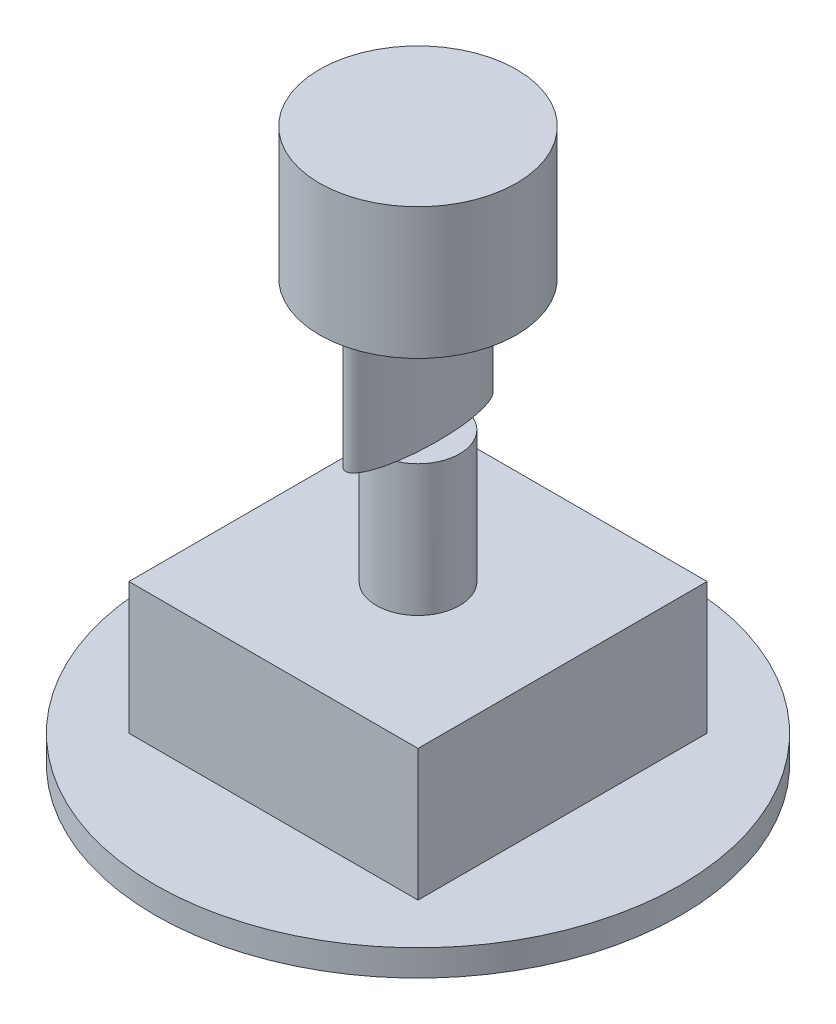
ISO-10303-21;
HEADER;
FILE_DESCRIPTION(('STEP AP214'),'2;1');
FILE_NAME('part.step','',(''),(''),'','','');
FILE_SCHEMA(('AUTOMOTIVE_DESIGN { 1 0 10303 214 1 1 1 1 }'));
ENDSEC;
DATA;
#1=APPLICATION_CONTEXT('core data for automotive mechanical design processes');
#2=APPLICATION_PROTOCOL_DEFINITION('international standard','automotive_design',2000,#1);
#3=PRODUCT_CONTEXT('',#1,'mechanical');
#4=PRODUCT('Part','Part','',(#3));
#5=PRODUCT_RELATED_PRODUCT_CATEGORY('part','',(#4));
#6=PRODUCT_DEFINITION_FORMATION('','',#4);
#7=PRODUCT_DEFINITION_CONTEXT('part definition',#1,'design');
#8=PRODUCT_DEFINITION('design','',#6,#7);
#9=PRODUCT_DEFINITION_SHAPE('','',#8);
#10=(LENGTH_UNIT() NAMED_UNIT(*) SI_UNIT(.MILLI.,.METRE.));
#11=(NAMED_UNIT(*) PLANE_ANGLE_UNIT() SI_UNIT($,.RADIAN.));
#12=(NAMED_UNIT(*) SI_UNIT($,.STERADIAN.) SOLID_ANGLE_UNIT());
#13=UNCERTAINTY_MEASURE_WITH_UNIT(LENGTH_MEASURE(1.E-05),#10,'distance_accuracy_value','');
#14=(GEOMETRIC_REPRESENTATION_CONTEXT(3) GLOBAL_UNCERTAINTY_ASSIGNED_CONTEXT((#13)) GLOBAL_UNIT_ASSIGNED_CONTEXT((#10,
#11,#12)) REPRESENTATION_CONTEXT('',''));
#15=CARTESIAN_POINT('',(0.,0.,0.));
#16=DIRECTION('',(0.,0.,1.));
#17=DIRECTION('',(1.,0.,0.));
#18=AXIS2_PLACEMENT_3D('',#15,#16,#17);
#19=CARTESIAN_POINT('',(0.,21.,0.));
#20=DIRECTION('',(0.,1.,0.));
#21=DIRECTION('',(0.,0.,1.));
#22=AXIS2_PLACEMENT_3D('',#19,#20,#21);
#23=PLANE('',#22);
#24=CARTESIAN_POINT('',(0.,21.,0.));
#25=DIRECTION('',(0.,1.,0.));
#26=DIRECTION('',(0.,0.,1.));
#27=AXIS2_PLACEMENT_3D('',#24,#25,#26);
#28=ELLIPSE('',#27,5.5,1.5);
#29=CARTESIAN_POINT('',(1.27408896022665,21.,2.90268794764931));
#30=VERTEX_POINT('',#29);
#31=CARTESIAN_POINT('',(1.27408896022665,21.,-2.90268794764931));
#32=VERTEX_POINT('',#31);
#33=EDGE_CURVE('E41',#30,#32,#28,.T.);
#34=ORIENTED_EDGE('',*,*,#33,.F.);
#35=CARTESIAN_POINT('',(0.,21.,0.));
#36=DIRECTION('',(0.,1.,0.));
#37=DIRECTION('',(0.,0.,1.));
#38=AXIS2_PLACEMENT_3D('',#35,#36,#37);
#39=CIRCLE('',#38,3.17);
#40=EDGE_CURVE('E92',#30,#32,#39,.T.);
#41=ORIENTED_EDGE('',*,*,#40,.T.);
#42=EDGE_LOOP('',(#34,#41));
#43=FACE_BOUND('',#42,.T.);
#44=ADVANCED_FACE('F31',(#43),#23,.T.);
#45=CARTESIAN_POINT('',(-11.,11.,11.));
#46=DIRECTION('',(0.,-1.,0.));
#47=DIRECTION('',(0.,0.,-1.));
#48=AXIS2_PLACEMENT_3D('',#45,#46,#47);
#49=PLANE('',#48);
#50=DIRECTION('',(0.,0.,1.));
#51=VECTOR('',#50,1.);
#52=CARTESIAN_POINT('',(-11.,11.,-11.));
#53=LINE('',#52,#51);
#54=CARTESIAN_POINT('',(-11.,11.,-11.));
#55=VERTEX_POINT('',#54);
#56=CARTESIAN_POINT('',(-11.,11.,11.));
#57=VERTEX_POINT('',#56);
#58=EDGE_CURVE('E110',#55,#57,#53,.T.);
#59=ORIENTED_EDGE('',*,*,#58,.T.);
#60=DIRECTION('',(1.,0.,0.));
#61=VECTOR('',#60,1.);
#62=CARTESIAN_POINT('',(11.,11.,11.));
#63=LINE('',#62,#61);
#64=CARTESIAN_POINT('',(11.,11.,11.));
#65=VERTEX_POINT('',#64);
#66=EDGE_CURVE('E113',#57,#65,#63,.T.);
#67=ORIENTED_EDGE('',*,*,#66,.T.);
#68=DIRECTION('',(0.,0.,-1.));
#69=VECTOR('',#68,1.);
#70=CARTESIAN_POINT('',(11.,11.,-11.));
#71=LINE('',#70,#69);
#72=CARTESIAN_POINT('',(11.,11.,-11.));
#73=VERTEX_POINT('',#72);
#74=EDGE_CURVE('E116',#65,#73,#71,.T.);
#75=ORIENTED_EDGE('',*,*,#74,.T.);
#76=DIRECTION('',(-1.,0.,0.));
#77=VECTOR('',#76,1.);
#78=CARTESIAN_POINT('',(11.,11.,-11.));
#79=LINE('',#78,#77);
#80=EDGE_CURVE('E118',#73,#55,#79,.T.);
#81=ORIENTED_EDGE('',*,*,#80,.T.);
#82=EDGE_LOOP('',(#59,#67,#75,#81));
#83=FACE_BOUND('',#82,.T.);
#84=CARTESIAN_POINT('',(0.,11.,0.));
#85=DIRECTION('',(0.,-1.,0.));
#86=DIRECTION('',(0.,0.,-1.));
#87=AXIS2_PLACEMENT_3D('',#84,#85,#86);
#88=CIRCLE('',#87,3.17);
#89=CARTESIAN_POINT('',(0.,11.,-3.17));
#90=VERTEX_POINT('',#89);
#91=EDGE_CURVE('E35',#90,#90,#88,.F.);
#92=ORIENTED_EDGE('',*,*,#91,.F.);
#93=EDGE_LOOP('',(#92));
#94=FACE_BOUND('',#93,.T.);
#95=ADVANCED_FACE('F159',(#83,#94),#49,.F.);
#96=CARTESIAN_POINT('',(0.,1.,0.));
#97=DIRECTION('',(0.,1.,0.));
#98=DIRECTION('',(0.,0.,1.));
#99=AXIS2_PLACEMENT_3D('',#96,#97,#98);
#100=PLANE('',#99);
#101=CARTESIAN_POINT('',(0.,1.,0.));
#102=DIRECTION('',(0.,1.,0.));
#103=DIRECTION('',(0.,0.,1.));
#104=AXIS2_PLACEMENT_3D('',#101,#102,#103);
#105=CIRCLE('',#104,20.);
#106=CARTESIAN_POINT('',(0.,1.,20.));
#107=VERTEX_POINT('',#106);
#108=EDGE_CURVE('E139',#107,#107,#105,.T.);
#109=ORIENTED_EDGE('',*,*,#108,.T.);
#110=EDGE_LOOP('',(#109));
#111=FACE_BOUND('',#110,.T.);
#112=DIRECTION('',(1.,0.,0.));
#113=VECTOR('',#112,1.);
#114=CARTESIAN_POINT('',(11.,1.,11.));
#115=LINE('',#114,#113);
#116=CARTESIAN_POINT('',(-11.,1.,11.));
#117=VERTEX_POINT('',#116);
#118=CARTESIAN_POINT('',(11.,1.,11.));
#119=VERTEX_POINT('',#118);
#120=EDGE_CURVE('E123',#117,#119,#115,.T.);
#121=ORIENTED_EDGE('',*,*,#120,.F.);
#122=DIRECTION('',(0.,0.,1.));
#123=VECTOR('',#122,1.);
#124=CARTESIAN_POINT('',(-11.,1.,-11.));
#125=LINE('',#124,#123);
#126=CARTESIAN_POINT('',(-11.,1.,-11.));
#127=VERTEX_POINT('',#126);
#128=EDGE_CURVE('E109',#127,#117,#125,.T.);
#129=ORIENTED_EDGE('',*,*,#128,.F.);
#130=DIRECTION('',(-1.,0.,0.));
#131=VECTOR('',#130,1.);
#132=CARTESIAN_POINT('',(11.,1.,-11.));
#133=LINE('',#132,#131);
#134=CARTESIAN_POINT('',(11.,1.,-11.));
#135=VERTEX_POINT('',#134);
#136=EDGE_CURVE('E114',#135,#127,#133,.T.);
#137=ORIENTED_EDGE('',*,*,#136,.F.);
#138=DIRECTION('',(0.,0.,-1.));
#139=VECTOR('',#138,1.);
#140=CARTESIAN_POINT('',(11.,1.,-11.));
#141=LINE('',#140,#139);
#142=EDGE_CURVE('E125',#119,#135,#141,.T.);
#143=ORIENTED_EDGE('',*,*,#142,.F.);
#144=EDGE_LOOP('',(#121,#129,#137,#143));
#145=FACE_BOUND('',#144,.T.);
#146=ADVANCED_FACE('F155',(#111,#145),#100,.T.);
#147=CARTESIAN_POINT('',(0.,1.,0.));
#148=DIRECTION('',(0.,-1.,0.));
#149=DIRECTION('',(0.,0.,-1.));
#150=AXIS2_PLACEMENT_3D('',#147,#148,#149);
#151=CYLINDRICAL_SURFACE('',#150,20.);
#152=ORIENTED_EDGE('',*,*,#108,.F.);
#153=EDGE_LOOP('',(#152));
#154=FACE_BOUND('',#153,.T.);
#155=CARTESIAN_POINT('',(0.,-1.,0.));
#156=DIRECTION('',(0.,1.,0.));
#157=DIRECTION('',(0.,0.,1.));
#158=AXIS2_PLACEMENT_3D('',#155,#156,#157);
#159=CIRCLE('',#158,20.);
#160=CARTESIAN_POINT('',(0.,-1.,20.));
#161=VERTEX_POINT('',#160);
#162=EDGE_CURVE('E138',#161,#161,#159,.T.);
#163=ORIENTED_EDGE('',*,*,#162,.T.);
#164=EDGE_LOOP('',(#163));
#165=FACE_BOUND('',#164,.T.);
#166=ADVANCED_FACE('F33',(#154,#165),#151,.T.);
#167=CARTESIAN_POINT('',(0.,-1.,0.));
#168=DIRECTION('',(0.,1.,0.));
#169=DIRECTION('',(0.,0.,1.));
#170=AXIS2_PLACEMENT_3D('',#167,#168,#169);
#171=PLANE('',#170);
#172=ORIENTED_EDGE('',*,*,#162,.F.);
#173=EDGE_LOOP('',(#172));
#174=FACE_BOUND('',#173,.T.);
#175=ADVANCED_FACE('F145',(#174),#171,.F.);
#176=CARTESIAN_POINT('',(-11.,11.,-11.));
#177=DIRECTION('',(1.,0.,0.));
#178=DIRECTION('',(0.,0.,-1.));
#179=AXIS2_PLACEMENT_3D('',#176,#177,#178);
#180=PLANE('',#179);
#181=ORIENTED_EDGE('',*,*,#128,.T.);
#182=DIRECTION('',(0.,-1.,0.));
#183=VECTOR('',#182,1.);
#184=CARTESIAN_POINT('',(-11.,11.,11.));
#185=LINE('',#184,#183);
#186=EDGE_CURVE('E136',#57,#117,#185,.T.);
#187=ORIENTED_EDGE('',*,*,#186,.F.);
#188=ORIENTED_EDGE('',*,*,#58,.F.);
#189=DIRECTION('',(0.,-1.,0.));
#190=VECTOR('',#189,1.);
#191=CARTESIAN_POINT('',(-11.,11.,-11.));
#192=LINE('',#191,#190);
#193=EDGE_CURVE('E120',#55,#127,#192,.T.);
#194=ORIENTED_EDGE('',*,*,#193,.T.);
#195=EDGE_LOOP('',(#181,#187,#188,#194));
#196=FACE_BOUND('',#195,.T.);
#197=ADVANCED_FACE('F147',(#196),#180,.F.);
#198=CARTESIAN_POINT('',(11.,11.,11.));
#199=DIRECTION('',(0.,0.,-1.));
#200=DIRECTION('',(-1.,0.,0.));
#201=AXIS2_PLACEMENT_3D('',#198,#199,#200);
#202=PLANE('',#201);
#203=ORIENTED_EDGE('',*,*,#120,.T.);
#204=DIRECTION('',(0.,-1.,0.));
#205=VECTOR('',#204,1.);
#206=CARTESIAN_POINT('',(11.,11.,11.));
#207=LINE('',#206,#205);
#208=EDGE_CURVE('E133',#65,#119,#207,.T.);
#209=ORIENTED_EDGE('',*,*,#208,.F.);
#210=ORIENTED_EDGE('',*,*,#66,.F.);
#211=ORIENTED_EDGE('',*,*,#186,.T.);
#212=EDGE_LOOP('',(#203,#209,#210,#211));
#213=FACE_BOUND('',#212,.T.);
#214=ADVANCED_FACE('F152',(#213),#202,.F.);
#215=CARTESIAN_POINT('',(11.,11.,-11.));
#216=DIRECTION('',(-1.,0.,0.));
#217=DIRECTION('',(0.,0.,1.));
#218=AXIS2_PLACEMENT_3D('',#215,#216,#217);
#219=PLANE('',#218);
#220=ORIENTED_EDGE('',*,*,#142,.T.);
#221=DIRECTION('',(0.,-1.,0.));
#222=VECTOR('',#221,1.);
#223=CARTESIAN_POINT('',(11.,11.,-11.));
#224=LINE('',#223,#222);
#225=EDGE_CURVE('E131',#73,#135,#224,.T.);
#226=ORIENTED_EDGE('',*,*,#225,.F.);
#227=ORIENTED_EDGE('',*,*,#74,.F.);
#228=ORIENTED_EDGE('',*,*,#208,.T.);
#229=EDGE_LOOP('',(#220,#226,#227,#228));
#230=FACE_BOUND('',#229,.T.);
#231=ADVANCED_FACE('F180',(#230),#219,.F.);
#232=CARTESIAN_POINT('',(11.,11.,-11.));
#233=DIRECTION('',(0.,0.,1.));
#234=DIRECTION('',(1.,0.,0.));
#235=AXIS2_PLACEMENT_3D('',#232,#233,#234);
#236=PLANE('',#235);
#237=ORIENTED_EDGE('',*,*,#136,.T.);
#238=ORIENTED_EDGE('',*,*,#193,.F.);
#239=ORIENTED_EDGE('',*,*,#80,.F.);
#240=ORIENTED_EDGE('',*,*,#225,.T.);
#241=EDGE_LOOP('',(#237,#238,#239,#240));
#242=FACE_BOUND('',#241,.T.);
#243=ADVANCED_FACE('F176',(#242),#236,.F.);
#244=CARTESIAN_POINT('',(0.,21.,0.));
#245=DIRECTION('',(0.,-1.,0.));
#246=DIRECTION('',(0.,0.,-1.));
#247=AXIS2_PLACEMENT_3D('',#244,#245,#246);
#248=CYLINDRICAL_SURFACE('',#247,3.17);
#249=ORIENTED_EDGE('',*,*,#40,.F.);
#250=CARTESIAN_POINT('',(-1.27408896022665,21.,2.90268794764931));
#251=VERTEX_POINT('',#250);
#252=EDGE_CURVE('E86',#251,#30,#39,.T.);
#253=ORIENTED_EDGE('',*,*,#252,.F.);
#254=CARTESIAN_POINT('',(-1.27408896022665,21.,-2.90268794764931));
#255=VERTEX_POINT('',#254);
#256=EDGE_CURVE('E83',#255,#251,#39,.T.);
#257=ORIENTED_EDGE('',*,*,#256,.F.);
#258=EDGE_CURVE('E53',#32,#255,#39,.T.);
#259=ORIENTED_EDGE('',*,*,#258,.F.);
#260=EDGE_LOOP('',(#249,#253,#257,#259));
#261=FACE_BOUND('',#260,.T.);
#262=ORIENTED_EDGE('',*,*,#91,.T.);
#263=EDGE_LOOP('',(#262));
#264=FACE_BOUND('',#263,.T.);
#265=ADVANCED_FACE('F90',(#261,#264),#248,.T.);
#266=EDGE_CURVE('E11',#255,#251,#28,.T.);
#267=ORIENTED_EDGE('',*,*,#266,.F.);
#268=ORIENTED_EDGE('',*,*,#256,.T.);
#269=EDGE_LOOP('',(#267,#268));
#270=FACE_BOUND('',#269,.T.);
#271=ADVANCED_FACE('F85',(#270),#23,.T.);
#272=CARTESIAN_POINT('',(0.,21.,0.));
#273=DIRECTION('',(0.,1.,0.));
#274=DIRECTION('',(0.,0.,1.));
#275=AXIS2_PLACEMENT_3D('',#272,#273,#274);
#276=PLANE('',#275);
#277=EDGE_CURVE('E42',#32,#255,#28,.T.);
#278=ORIENTED_EDGE('',*,*,#277,.F.);
#279=ORIENTED_EDGE('',*,*,#258,.T.);
#280=EDGE_LOOP('',(#278,#279));
#281=FACE_BOUND('',#280,.T.);
#282=ADVANCED_FACE('F170',(#281),#276,.F.);
#283=EDGE_CURVE('E96',#251,#30,#28,.T.);
#284=ORIENTED_EDGE('',*,*,#283,.F.);
#285=ORIENTED_EDGE('',*,*,#252,.T.);
#286=EDGE_LOOP('',(#284,#285));
#287=FACE_BOUND('',#286,.T.);
#288=ADVANCED_FACE('F97',(#287),#276,.F.);
#289=CARTESIAN_POINT('',(0.,31.,0.));
#290=DIRECTION('',(0.,1.,0.));
#291=DIRECTION('',(0.,0.,1.));
#292=AXIS2_PLACEMENT_3D('',#289,#290,#291);
#293=ELLIPSE('',#292,5.5,1.5);
#294=DIRECTION('',(0.,-1.,0.));
#295=VECTOR('',#294,1.);
#296=SURFACE_OF_LINEAR_EXTRUSION('',#293,#295);
#297=CARTESIAN_POINT('',(0.,31.,5.5));
#298=VERTEX_POINT('',#297);
#299=EDGE_CURVE('E95',#298,#298,#293,.T.);
#300=ORIENTED_EDGE('',*,*,#299,.F.);
#301=EDGE_LOOP('',(#300));
#302=FACE_BOUND('',#301,.T.);
#303=ORIENTED_EDGE('',*,*,#33,.T.);
#304=ORIENTED_EDGE('',*,*,#277,.T.);
#305=ORIENTED_EDGE('',*,*,#266,.T.);
#306=ORIENTED_EDGE('',*,*,#283,.T.);
#307=EDGE_LOOP('',(#303,#304,#305,#306));
#308=FACE_BOUND('',#307,.T.);
#309=ADVANCED_FACE('F102',(#302,#308),#296,.F.);
#310=CARTESIAN_POINT('',(0.,31.,0.));
#311=DIRECTION('',(0.,1.,0.));
#312=DIRECTION('',(0.,0.,1.));
#313=AXIS2_PLACEMENT_3D('',#310,#311,#312);
#314=PLANE('',#313);
#315=CARTESIAN_POINT('',(0.,31.,0.));
#316=DIRECTION('',(0.,1.,0.));
#317=DIRECTION('',(0.,0.,1.));
#318=AXIS2_PLACEMENT_3D('',#315,#316,#317);
#319=CIRCLE('',#318,7.5);
#320=CARTESIAN_POINT('',(0.,31.,7.5));
#321=VERTEX_POINT('',#320);
#322=EDGE_CURVE('E314',#321,#321,#319,.T.);
#323=ORIENTED_EDGE('',*,*,#322,.F.);
#324=EDGE_LOOP('',(#323));
#325=FACE_BOUND('',#324,.T.);
#326=ORIENTED_EDGE('',*,*,#299,.T.);
#327=EDGE_LOOP('',(#326));
#328=FACE_BOUND('',#327,.T.);
#329=ADVANCED_FACE('F278',(#325,#328),#314,.F.);
#330=CARTESIAN_POINT('',(0.,41.,0.));
#331=DIRECTION('',(0.,-1.,0.));
#332=DIRECTION('',(0.,0.,-1.));
#333=AXIS2_PLACEMENT_3D('',#330,#331,#332);
#334=CYLINDRICAL_SURFACE('',#333,7.5);
#335=CARTESIAN_POINT('',(0.,41.,0.));
#336=DIRECTION('',(0.,1.,0.));
#337=DIRECTION('',(0.,0.,1.));
#338=AXIS2_PLACEMENT_3D('',#335,#336,#337);
#339=CIRCLE('',#338,7.5);
#340=CARTESIAN_POINT('',(0.,41.,7.5));
#341=VERTEX_POINT('',#340);
#342=EDGE_CURVE('E100',#341,#341,#339,.T.);
#343=ORIENTED_EDGE('',*,*,#342,.F.);
#344=EDGE_LOOP('',(#343));
#345=FACE_BOUND('',#344,.T.);
#346=ORIENTED_EDGE('',*,*,#322,.T.);
#347=EDGE_LOOP('',(#346));
#348=FACE_BOUND('',#347,.T.);
#349=ADVANCED_FACE('F286',(#345,#348),#334,.T.);
#350=CARTESIAN_POINT('',(0.,41.,0.));
#351=DIRECTION('',(0.,1.,0.));
#352=DIRECTION('',(0.,0.,1.));
#353=AXIS2_PLACEMENT_3D('',#350,#351,#352);
#354=PLANE('',#353);
#355=ORIENTED_EDGE('',*,*,#342,.T.);
#356=EDGE_LOOP('',(#355));
#357=FACE_BOUND('',#356,.T.);
#358=ADVANCED_FACE('F295',(#357),#354,.T.);
#359=CLOSED_SHELL('',(#44,#95,#146,#166,#175,#197,#214,#231,#243,#265,#271,#282,#288,#309,#329,
#349,#358));
#360=MANIFOLD_SOLID_BREP('B2',#359);
#361=ADVANCED_BREP_SHAPE_REPRESENTATION('',(#18,#360),#14);
#362=SHAPE_DEFINITION_REPRESENTATION(#9,#361);
ENDSEC;
END-ISO-10303-21;
